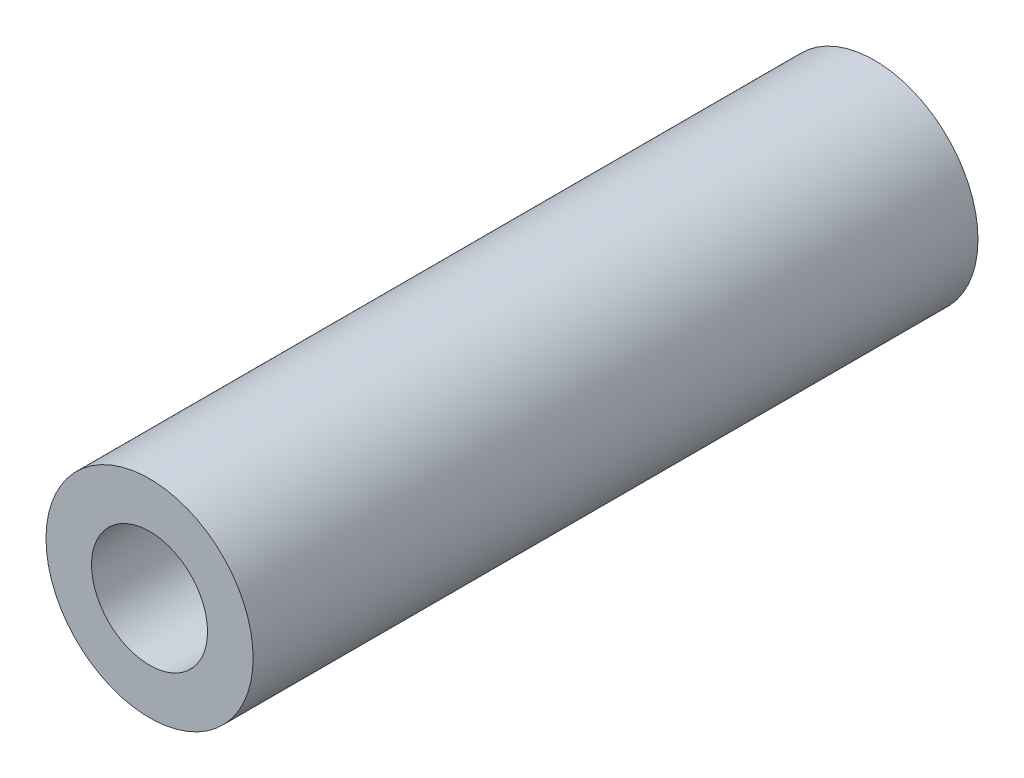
from build123d import *

# Parameters (mm, degrees)
SKETCH1_R      = 3.175
SKETCH1_R_2    = 1.778
EXTRUDE1_DEPTH = 11.1125


with BuildPart() as part:
    # Sketch1 → Extrude1 (new, symmetric)
    with BuildSketch(Plane.XY):
        Circle(SKETCH1_R)
        Circle(SKETCH1_R_2, mode=Mode.SUBTRACT)
    extrude(amount=EXTRUDE1_DEPTH, both=True)


solid = part.part
